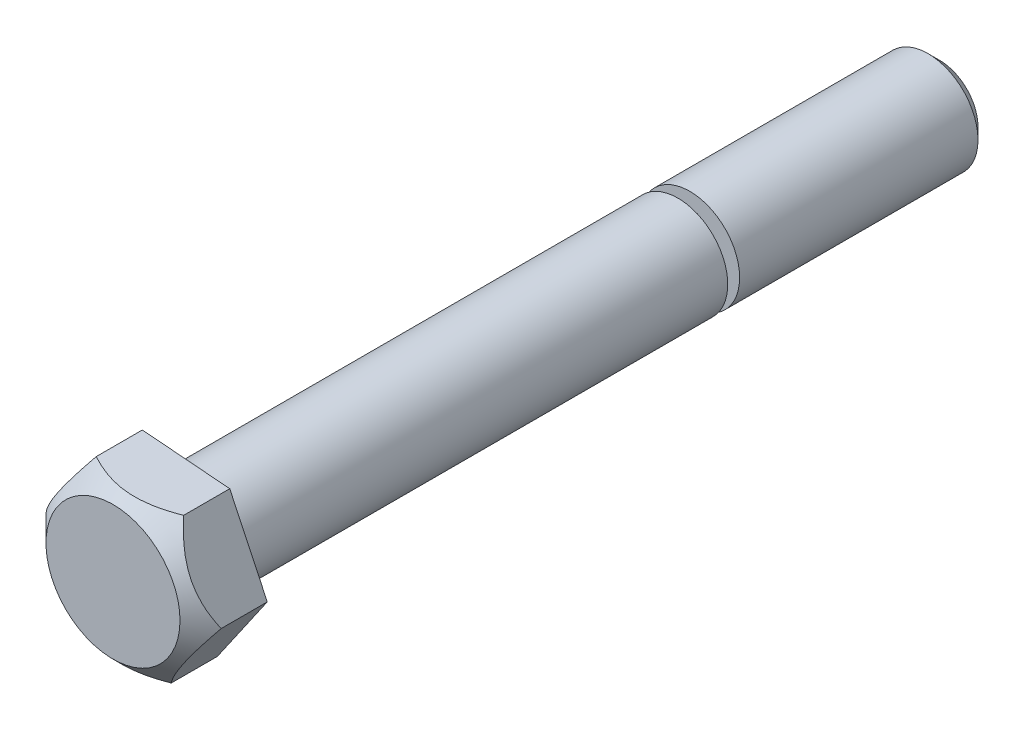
ISO-10303-21;
HEADER;
FILE_DESCRIPTION(('STEP AP214'),'2;1');
FILE_NAME('part.step','',(''),(''),'','','');
FILE_SCHEMA(('AUTOMOTIVE_DESIGN { 1 0 10303 214 1 1 1 1 }'));
ENDSEC;
DATA;
#1=APPLICATION_CONTEXT('core data for automotive mechanical design processes');
#2=APPLICATION_PROTOCOL_DEFINITION('international standard','automotive_design',2000,#1);
#3=PRODUCT_CONTEXT('',#1,'mechanical');
#4=PRODUCT('Part','Part','',(#3));
#5=PRODUCT_RELATED_PRODUCT_CATEGORY('part','',(#4));
#6=PRODUCT_DEFINITION_FORMATION('','',#4);
#7=PRODUCT_DEFINITION_CONTEXT('part definition',#1,'design');
#8=PRODUCT_DEFINITION('design','',#6,#7);
#9=PRODUCT_DEFINITION_SHAPE('','',#8);
#10=(LENGTH_UNIT() NAMED_UNIT(*) SI_UNIT(.MILLI.,.METRE.));
#11=(NAMED_UNIT(*) PLANE_ANGLE_UNIT() SI_UNIT($,.RADIAN.));
#12=(NAMED_UNIT(*) SI_UNIT($,.STERADIAN.) SOLID_ANGLE_UNIT());
#13=UNCERTAINTY_MEASURE_WITH_UNIT(LENGTH_MEASURE(1.E-05),#10,'distance_accuracy_value','');
#14=(GEOMETRIC_REPRESENTATION_CONTEXT(3) GLOBAL_UNCERTAINTY_ASSIGNED_CONTEXT((#13)) GLOBAL_UNIT_ASSIGNED_CONTEXT((#10,
#11,#12)) REPRESENTATION_CONTEXT('',''));
#15=CARTESIAN_POINT('',(0.,0.,0.));
#16=DIRECTION('',(0.,0.,1.));
#17=DIRECTION('',(1.,0.,0.));
#18=AXIS2_PLACEMENT_3D('',#15,#16,#17);
#19=CARTESIAN_POINT('',(0.,0.,31.75));
#20=DIRECTION('',(0.,0.,-1.));
#21=DIRECTION('',(-1.,0.,0.));
#22=AXIS2_PLACEMENT_3D('',#19,#20,#21);
#23=CYLINDRICAL_SURFACE('',#22,2.0828);
#24=CARTESIAN_POINT('',(0.,0.,10.4385878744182));
#25=DIRECTION('',(0.,0.,1.));
#26=DIRECTION('',(1.,0.,0.));
#27=AXIS2_PLACEMENT_3D('',#24,#25,#26);
#28=CIRCLE('',#27,2.0828);
#29=CARTESIAN_POINT('',(2.0828,0.,10.4385878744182));
#30=VERTEX_POINT('',#29);
#31=EDGE_CURVE('E119',#30,#30,#28,.T.);
#32=ORIENTED_EDGE('',*,*,#31,.F.);
#33=EDGE_LOOP('',(#32));
#34=FACE_BOUND('',#33,.T.);
#35=CARTESIAN_POINT('',(0.,0.,0.475372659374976));
#36=DIRECTION('',(0.,0.,1.));
#37=DIRECTION('',(1.,0.,0.));
#38=AXIS2_PLACEMENT_3D('',#35,#36,#37);
#39=CIRCLE('',#38,2.0828);
#40=CARTESIAN_POINT('',(2.0828,0.,0.475372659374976));
#41=VERTEX_POINT('',#40);
#42=EDGE_CURVE('E38',#41,#41,#39,.F.);
#43=ORIENTED_EDGE('',*,*,#42,.F.);
#44=EDGE_LOOP('',(#43));
#45=FACE_BOUND('',#44,.T.);
#46=ADVANCED_FACE('F34',(#34,#45),#23,.T.);
#47=CARTESIAN_POINT('',(1.56859845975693,-3.31365843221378,34.544));
#48=DIRECTION('',(-0.822458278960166,0.568825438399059,0.));
#49=DIRECTION('',(-0.568825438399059,-0.822458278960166,0.));
#50=AXIS2_PLACEMENT_3D('',#47,#48,#49);
#51=PLANE('',#50);
#52=CARTESIAN_POINT('',(1.56846013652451,-3.31385843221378,33.6783241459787));
#53=CARTESIAN_POINT('',(1.64014513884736,-3.21020989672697,33.7412813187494));
#54=CARTESIAN_POINT('',(1.71302880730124,-3.10482822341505,33.8005408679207));
#55=CARTESIAN_POINT('',(1.86164657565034,-2.88994347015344,33.9090435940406));
#56=CARTESIAN_POINT('',(1.93739480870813,-2.78041995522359,33.9582264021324));
#57=CARTESIAN_POINT('',(2.09013748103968,-2.55957104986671,34.0424774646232));
#58=CARTESIAN_POINT('',(2.16709302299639,-2.44830190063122,34.0777574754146));
#59=CARTESIAN_POINT('',(2.32269827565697,-2.22331402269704,34.1321135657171));
#60=CARTESIAN_POINT('',(2.40134323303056,-2.10960216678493,34.1512302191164));
#61=CARTESIAN_POINT('',(2.53688438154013,-1.9136247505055,34.1684785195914));
#62=CARTESIAN_POINT('',(2.59360553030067,-1.83161228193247,34.1710317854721));
#63=CARTESIAN_POINT('',(2.70695556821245,-1.66772074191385,34.1667295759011));
#64=CARTESIAN_POINT('',(2.76358441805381,-1.58584172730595,34.1598708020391));
#65=CARTESIAN_POINT('',(2.8763056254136,-1.42285940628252,34.1371361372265));
#66=CARTESIAN_POINT('',(2.93239731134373,-1.34175707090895,34.1212501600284));
#67=CARTESIAN_POINT('',(3.0436173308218,-1.18094530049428,34.0813281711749));
#68=CARTESIAN_POINT('',(3.09874573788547,-1.10123575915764,34.0572927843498));
#69=CARTESIAN_POINT('',(3.19661528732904,-0.959727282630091,34.0078406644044));
#70=CARTESIAN_POINT('',(3.2395730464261,-0.897615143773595,33.9837237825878));
#71=CARTESIAN_POINT('',(3.32471733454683,-0.774505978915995,33.9316031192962));
#72=CARTESIAN_POINT('',(3.36690383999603,-0.713508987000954,33.9035992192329));
#73=CARTESIAN_POINT('',(3.45037271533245,-0.59282228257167,33.8443323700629));
#74=CARTESIAN_POINT('',(3.49165745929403,-0.533129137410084,33.8130796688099));
#75=CARTESIAN_POINT('',(3.57346233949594,-0.414848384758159,33.7477256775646));
#76=CARTESIAN_POINT('',(3.61398292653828,-0.356260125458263,33.7136261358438));
#77=CARTESIAN_POINT('',(3.65414993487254,-0.298183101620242,33.6783241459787));
#78=B_SPLINE_CURVE_WITH_KNOTS('',3,(#52,#53,#54,#55,#56,#57,#58,#59,#60,#61,#62,#63,#64,#65,#66,
#67,#68,#69,#70,#71,#72,#73,#74,#75,#76,#77),.UNSPECIFIED.,.F.,.F.,(4,2,2,2,2,2,2,2,2,2,2,2,4),
(0.,0.422913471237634,0.848290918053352,1.26691269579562,1.68448048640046,1.98330429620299,
2.28223285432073,2.58149606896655,2.8807363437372,3.11845712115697,3.35618515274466,
3.59318483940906,3.83004003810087),.UNSPECIFIED.);
#79=CARTESIAN_POINT('',(1.56859845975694,-3.31365843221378,33.6784457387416));
#80=VERTEX_POINT('',#79);
#81=CARTESIAN_POINT('',(3.65401161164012,-0.298383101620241,33.6784457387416));
#82=VERTEX_POINT('',#81);
#83=EDGE_CURVE('E90',#80,#82,#78,.T.);
#84=ORIENTED_EDGE('',*,*,#83,.F.);
#85=DIRECTION('',(0.,0.,-1.));
#86=VECTOR('',#85,1.);
#87=CARTESIAN_POINT('',(1.56859845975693,-3.31365843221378,34.544));
#88=LINE('',#87,#86);
#89=CARTESIAN_POINT('',(1.56859845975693,-3.31365843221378,31.75));
#90=VERTEX_POINT('',#89);
#91=EDGE_CURVE('E59',#80,#90,#88,.T.);
#92=ORIENTED_EDGE('',*,*,#91,.T.);
#93=DIRECTION('',(0.568825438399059,0.822458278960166,0.));
#94=VECTOR('',#93,1.);
#95=CARTESIAN_POINT('',(1.56859845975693,-3.31365843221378,31.75));
#96=LINE('',#95,#94);
#97=CARTESIAN_POINT('',(3.65401161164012,-0.298383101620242,31.75));
#98=VERTEX_POINT('',#97);
#99=EDGE_CURVE('E125',#90,#98,#96,.T.);
#100=ORIENTED_EDGE('',*,*,#99,.T.);
#101=DIRECTION('',(0.,0.,-1.));
#102=VECTOR('',#101,1.);
#103=CARTESIAN_POINT('',(3.65401161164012,-0.298383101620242,34.544));
#104=LINE('',#103,#102);
#105=EDGE_CURVE('E43',#82,#98,#104,.T.);
#106=ORIENTED_EDGE('',*,*,#105,.F.);
#107=EDGE_LOOP('',(#84,#92,#100,#106));
#108=FACE_BOUND('',#107,.T.);
#109=ADVANCED_FACE('F97',(#108),#51,.F.);
#110=CARTESIAN_POINT('',(3.65401161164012,-0.298383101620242,34.544));
#111=DIRECTION('',(-0.903846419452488,-0.427857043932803,0.));
#112=DIRECTION('',(0.427857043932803,-0.903846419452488,0.));
#113=AXIS2_PLACEMENT_3D('',#110,#111,#112);
#114=PLANE('',#113);
#115=CARTESIAN_POINT('',(3.65410628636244,-0.298583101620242,33.6783350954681));
#116=CARTESIAN_POINT('',(3.60018708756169,-0.184678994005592,33.7412910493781));
#117=CARTESIAN_POINT('',(3.54536629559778,-0.0688702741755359,33.8005493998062));
#118=CARTESIAN_POINT('',(3.43358074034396,0.167276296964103,33.9090498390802));
#119=CARTESIAN_POINT('',(3.37660534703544,0.287636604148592,33.9582315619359));
#120=CARTESIAN_POINT('',(3.2617172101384,0.530337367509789,34.0424807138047));
#121=CARTESIAN_POINT('',(3.20383372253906,0.65261602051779,34.0777598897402));
#122=CARTESIAN_POINT('',(3.08679247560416,0.899865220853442,34.1321146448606));
#123=CARTESIAN_POINT('',(3.02763829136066,1.02482821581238,34.1512307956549));
#124=CARTESIAN_POINT('',(2.92568817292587,1.24019746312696,34.1684786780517));
#125=CARTESIAN_POINT('',(2.8830238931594,1.33032559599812,34.1710318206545));
#126=CARTESIAN_POINT('',(2.79776473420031,1.51043525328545,34.1667293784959));
#127=CARTESIAN_POINT('',(2.75516988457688,1.6004167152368,34.1598704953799));
#128=CARTESIAN_POINT('',(2.67038372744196,1.77952715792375,34.1371356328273));
#129=CARTESIAN_POINT('',(2.62819292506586,1.8686550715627,34.1212495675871));
#130=CARTESIAN_POINT('',(2.54453593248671,2.04538015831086,34.0813274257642));
#131=CARTESIAN_POINT('',(2.50306968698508,2.13297744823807,34.0572919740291));
#132=CARTESIAN_POINT('',(2.42945551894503,2.28848710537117,34.0078403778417));
#133=CARTESIAN_POINT('',(2.39714464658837,2.3567437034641,33.9837242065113));
#134=CARTESIAN_POINT('',(2.33310296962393,2.4920315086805,33.9316051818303));
#135=CARTESIAN_POINT('',(2.30137218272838,2.55906267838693,33.9036022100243));
#136=CARTESIAN_POINT('',(2.23859064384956,2.69168844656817,33.8443373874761));
#137=CARTESIAN_POINT('',(2.20753810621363,2.75728681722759,33.8130857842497));
#138=CARTESIAN_POINT('',(2.14600811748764,2.88726869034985,33.747734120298));
#139=CARTESIAN_POINT('',(2.11553032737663,2.95165290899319,33.7136358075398));
#140=CARTESIAN_POINT('',(2.08531847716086,3.01547533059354,33.6783350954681));
#141=B_SPLINE_CURVE_WITH_KNOTS('',3,(#115,#116,#117,#118,#119,#120,#121,#122,#123,#124,#125,
#126,#127,#128,#129,#130,#131,#132,#133,#134,#135,#136,#137,#138,#139,#140),.UNSPECIFIED.,.F.,
.F.,(4,2,2,2,2,2,2,2,2,2,2,2,4),(0.,0.422908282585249,0.848280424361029,1.26689717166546,
1.68445998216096,1.98328359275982,2.28221194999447,2.58147494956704,2.88071500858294,
3.11842888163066,3.35615000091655,3.59314278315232,3.82999110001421),.UNSPECIFIED.);
#142=CARTESIAN_POINT('',(2.08541315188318,3.01527533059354,33.6784457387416));
#143=VERTEX_POINT('',#142);
#144=EDGE_CURVE('E99',#82,#143,#141,.T.);
#145=ORIENTED_EDGE('',*,*,#144,.F.);
#146=ORIENTED_EDGE('',*,*,#105,.T.);
#147=DIRECTION('',(-0.427857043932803,0.903846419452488,0.));
#148=VECTOR('',#147,1.);
#149=CARTESIAN_POINT('',(3.65401161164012,-0.298383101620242,31.75));
#150=LINE('',#149,#148);
#151=CARTESIAN_POINT('',(2.08541315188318,3.01527533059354,31.75));
#152=VERTEX_POINT('',#151);
#153=EDGE_CURVE('E341',#98,#152,#150,.T.);
#154=ORIENTED_EDGE('',*,*,#153,.T.);
#155=DIRECTION('',(0.,0.,-1.));
#156=VECTOR('',#155,1.);
#157=CARTESIAN_POINT('',(2.08541315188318,3.01527533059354,34.544));
#158=LINE('',#157,#156);
#159=EDGE_CURVE('E116',#143,#152,#158,.T.);
#160=ORIENTED_EDGE('',*,*,#159,.F.);
#161=EDGE_LOOP('',(#145,#146,#154,#160));
#162=FACE_BOUND('',#161,.T.);
#163=ADVANCED_FACE('F184',(#162),#114,.F.);
#164=CARTESIAN_POINT('',(2.08541315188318,3.01527533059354,34.544));
#165=DIRECTION('',(-0.0813881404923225,-0.996682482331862,0.));
#166=DIRECTION('',(0.996682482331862,-0.0813881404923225,0.));
#167=AXIS2_PLACEMENT_3D('',#164,#165,#166);
#168=PLANE('',#167);
#169=CARTESIAN_POINT('',(2.08561315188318,3.01525899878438,33.6783454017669));
#170=CARTESIAN_POINT('',(1.96001094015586,3.02551555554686,33.7413002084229));
#171=CARTESIAN_POINT('',(1.83230852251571,3.03594361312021,33.8005574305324));
#172=CARTESIAN_POINT('',(1.57190948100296,3.05720755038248,33.9090557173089));
#173=CARTESIAN_POINT('',(1.43918809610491,3.06804545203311,33.9582364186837));
#174=CARTESIAN_POINT('',(1.17156182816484,3.08989955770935,34.0424837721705));
#175=CARTESIAN_POINT('',(1.03672509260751,3.10091019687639,34.0777621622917));
#176=CARTESIAN_POINT('',(0.764083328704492,3.12317386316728,34.1321156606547));
#177=CARTESIAN_POINT('',(0.626286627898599,3.13442621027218,34.1512313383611));
#178=CARTESIAN_POINT('',(0.388797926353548,3.15381931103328,34.1684788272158));
#179=CARTESIAN_POINT('',(0.289412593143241,3.1619350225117,34.17103185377));
#180=CARTESIAN_POINT('',(0.0908036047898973,3.17815324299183,34.1667291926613));
#181=CARTESIAN_POINT('',(-0.00841998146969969,3.18625574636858,34.1598702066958));
#182=CARTESIAN_POINT('',(-0.205927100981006,3.20238398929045,34.1371351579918));
#183=CARTESIAN_POINT('',(-0.304209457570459,3.21040963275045,34.1212490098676));
#184=CARTESIAN_POINT('',(-0.499086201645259,3.22632308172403,34.081326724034));
#185=CARTESIAN_POINT('',(-0.595680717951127,3.23421089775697,34.0572912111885));
#186=CARTESIAN_POINT('',(-0.767160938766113,3.24821380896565,34.0078401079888));
#187=CARTESIAN_POINT('',(-0.842426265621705,3.25435990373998,33.9837246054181));
#188=CARTESIAN_POINT('',(-0.991605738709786,3.26654175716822,33.9316071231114));
#189=CARTESIAN_POINT('',(-1.0655198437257,3.27257751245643,33.9036050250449));
#190=CARTESIAN_POINT('',(-1.21176400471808,3.28451967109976,33.8443421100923));
#191=CARTESIAN_POINT('',(-1.28409822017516,3.29042641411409,33.813091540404));
#192=CARTESIAN_POINT('',(-1.4274270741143,3.30213051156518,33.7477420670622));
#193=CARTESIAN_POINT('',(-1.49842250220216,3.30792793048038,33.7136449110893));
#194=CARTESIAN_POINT('',(-1.56879845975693,3.31367476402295,33.6783454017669));
#195=B_SPLINE_CURVE_WITH_KNOTS('',3,(#169,#170,#171,#172,#173,#174,#175,#176,#177,#178,#179,
#180,#181,#182,#183,#184,#185,#186,#187,#188,#189,#190,#191,#192,#193,#194),.UNSPECIFIED.,.F.,
.F.,(4,2,2,2,2,2,2,2,2,2,2,2,4),(0.,0.422903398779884,0.848270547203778,1.26688255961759,
1.68444068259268,1.98326410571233,2.28219227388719,2.5814550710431,2.88069492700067,
3.11840230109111,3.3561169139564,3.59310319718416,3.829945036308),.UNSPECIFIED.);
#196=CARTESIAN_POINT('',(-1.56859845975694,3.31365843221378,33.6784457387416));
#197=VERTEX_POINT('',#196);
#198=EDGE_CURVE('E169',#143,#197,#195,.T.);
#199=ORIENTED_EDGE('',*,*,#198,.F.);
#200=ORIENTED_EDGE('',*,*,#159,.T.);
#201=DIRECTION('',(-0.996682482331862,0.0813881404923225,0.));
#202=VECTOR('',#201,1.);
#203=CARTESIAN_POINT('',(2.08541315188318,3.01527533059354,31.75));
#204=LINE('',#203,#202);
#205=CARTESIAN_POINT('',(-1.56859845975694,3.31365843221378,31.75));
#206=VERTEX_POINT('',#205);
#207=EDGE_CURVE('E336',#152,#206,#204,.T.);
#208=ORIENTED_EDGE('',*,*,#207,.T.);
#209=DIRECTION('',(0.,0.,-1.));
#210=VECTOR('',#209,1.);
#211=CARTESIAN_POINT('',(-1.56859845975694,3.31365843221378,34.544));
#212=LINE('',#211,#210);
#213=EDGE_CURVE('E114',#197,#206,#212,.T.);
#214=ORIENTED_EDGE('',*,*,#213,.F.);
#215=EDGE_LOOP('',(#199,#200,#208,#214));
#216=FACE_BOUND('',#215,.T.);
#217=ADVANCED_FACE('F187',(#216),#168,.F.);
#218=CARTESIAN_POINT('',(-1.56859845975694,3.31365843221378,34.544));
#219=DIRECTION('',(0.822458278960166,-0.568825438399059,0.));
#220=DIRECTION('',(0.568825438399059,0.822458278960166,0.));
#221=AXIS2_PLACEMENT_3D('',#218,#219,#220);
#222=PLANE('',#221);
#223=CARTESIAN_POINT('',(-1.56846013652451,3.31385843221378,33.6783241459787));
#224=CARTESIAN_POINT('',(-1.64014513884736,3.21020989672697,33.7412813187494));
#225=CARTESIAN_POINT('',(-1.71302880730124,3.10482822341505,33.8005408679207));
#226=CARTESIAN_POINT('',(-1.86164657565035,2.88994347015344,33.9090435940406));
#227=CARTESIAN_POINT('',(-1.93739480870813,2.78041995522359,33.9582264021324));
#228=CARTESIAN_POINT('',(-2.09013748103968,2.55957104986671,34.0424774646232));
#229=CARTESIAN_POINT('',(-2.1670930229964,2.44830190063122,34.0777574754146));
#230=CARTESIAN_POINT('',(-2.32269827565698,2.22331402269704,34.1321135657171));
#231=CARTESIAN_POINT('',(-2.40134323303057,2.10960216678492,34.1512302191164));
#232=CARTESIAN_POINT('',(-2.53688438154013,1.91362475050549,34.1684785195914));
#233=CARTESIAN_POINT('',(-2.59360553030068,1.83161228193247,34.1710317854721));
#234=CARTESIAN_POINT('',(-2.70695556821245,1.66772074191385,34.1667295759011));
#235=CARTESIAN_POINT('',(-2.76358441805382,1.58584172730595,34.1598708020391));
#236=CARTESIAN_POINT('',(-2.87630562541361,1.42285940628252,34.1371361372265));
#237=CARTESIAN_POINT('',(-2.93239731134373,1.34175707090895,34.1212501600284));
#238=CARTESIAN_POINT('',(-3.04361733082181,1.18094530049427,34.0813281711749));
#239=CARTESIAN_POINT('',(-3.09874573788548,1.10123575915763,34.0572927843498));
#240=CARTESIAN_POINT('',(-3.19661528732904,0.959727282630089,34.0078406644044));
#241=CARTESIAN_POINT('',(-3.2395730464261,0.897615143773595,33.9837237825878));
#242=CARTESIAN_POINT('',(-3.32471733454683,0.774505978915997,33.9316031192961));
#243=CARTESIAN_POINT('',(-3.36690383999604,0.713508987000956,33.9035992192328));
#244=CARTESIAN_POINT('',(-3.45037271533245,0.592822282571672,33.8443323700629));
#245=CARTESIAN_POINT('',(-3.49165745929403,0.533129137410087,33.8130796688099));
#246=CARTESIAN_POINT('',(-3.57346233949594,0.414848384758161,33.7477256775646));
#247=CARTESIAN_POINT('',(-3.61398292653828,0.356260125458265,33.7136261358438));
#248=CARTESIAN_POINT('',(-3.65414993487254,0.298183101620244,33.6783241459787));
#249=B_SPLINE_CURVE_WITH_KNOTS('',3,(#223,#224,#225,#226,#227,#228,#229,#230,#231,#232,#233,
#234,#235,#236,#237,#238,#239,#240,#241,#242,#243,#244,#245,#246,#247,#248),.UNSPECIFIED.,.F.,
.F.,(4,2,2,2,2,2,2,2,2,2,2,2,4),(0.,0.422913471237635,0.848290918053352,1.26691269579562,
1.68448048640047,1.98330429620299,2.28223285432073,2.58149606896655,2.8807363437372,
3.11845712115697,3.35618515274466,3.59318483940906,3.83004003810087),.UNSPECIFIED.);
#250=CARTESIAN_POINT('',(-3.65401161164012,0.298383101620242,33.6784457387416));
#251=VERTEX_POINT('',#250);
#252=EDGE_CURVE('E163',#197,#251,#249,.T.);
#253=ORIENTED_EDGE('',*,*,#252,.F.);
#254=ORIENTED_EDGE('',*,*,#213,.T.);
#255=DIRECTION('',(-0.568825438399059,-0.822458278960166,0.));
#256=VECTOR('',#255,1.);
#257=CARTESIAN_POINT('',(-1.56859845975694,3.31365843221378,31.75));
#258=LINE('',#257,#256);
#259=CARTESIAN_POINT('',(-3.65401161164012,0.298383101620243,31.75));
#260=VERTEX_POINT('',#259);
#261=EDGE_CURVE('E332',#206,#260,#258,.T.);
#262=ORIENTED_EDGE('',*,*,#261,.T.);
#263=DIRECTION('',(0.,0.,-1.));
#264=VECTOR('',#263,1.);
#265=CARTESIAN_POINT('',(-3.65401161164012,0.298383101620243,34.544));
#266=LINE('',#265,#264);
#267=EDGE_CURVE('E107',#251,#260,#266,.T.);
#268=ORIENTED_EDGE('',*,*,#267,.F.);
#269=EDGE_LOOP('',(#253,#254,#262,#268));
#270=FACE_BOUND('',#269,.T.);
#271=ADVANCED_FACE('F286',(#270),#222,.F.);
#272=CARTESIAN_POINT('',(-3.65401161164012,0.298383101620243,34.544));
#273=DIRECTION('',(0.903846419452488,0.427857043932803,0.));
#274=DIRECTION('',(-0.427857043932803,0.903846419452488,0.));
#275=AXIS2_PLACEMENT_3D('',#272,#273,#274);
#276=PLANE('',#275);
#277=CARTESIAN_POINT('',(-3.65410628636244,0.298583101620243,33.6783350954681));
#278=CARTESIAN_POINT('',(-3.60018708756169,0.184678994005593,33.7412910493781));
#279=CARTESIAN_POINT('',(-3.54536629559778,0.0688702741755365,33.8005493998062));
#280=CARTESIAN_POINT('',(-3.43358074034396,-0.167276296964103,33.9090498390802));
#281=CARTESIAN_POINT('',(-3.37660534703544,-0.287636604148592,33.9582315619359));
#282=CARTESIAN_POINT('',(-3.2617172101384,-0.530337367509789,34.0424807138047));
#283=CARTESIAN_POINT('',(-3.20383372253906,-0.65261602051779,34.0777598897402));
#284=CARTESIAN_POINT('',(-3.08679247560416,-0.899865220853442,34.1321146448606));
#285=CARTESIAN_POINT('',(-3.02763829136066,-1.02482821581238,34.1512307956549));
#286=CARTESIAN_POINT('',(-2.92568817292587,-1.24019746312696,34.1684786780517));
#287=CARTESIAN_POINT('',(-2.8830238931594,-1.33032559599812,34.1710318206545));
#288=CARTESIAN_POINT('',(-2.79776473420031,-1.51043525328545,34.1667293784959));
#289=CARTESIAN_POINT('',(-2.75516988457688,-1.6004167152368,34.1598704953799));
#290=CARTESIAN_POINT('',(-2.67038372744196,-1.77952715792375,34.1371356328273));
#291=CARTESIAN_POINT('',(-2.62819292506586,-1.8686550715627,34.1212495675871));
#292=CARTESIAN_POINT('',(-2.54453593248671,-2.04538015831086,34.0813274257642));
#293=CARTESIAN_POINT('',(-2.50306968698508,-2.13297744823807,34.0572919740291));
#294=CARTESIAN_POINT('',(-2.42945551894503,-2.28848710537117,34.0078403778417));
#295=CARTESIAN_POINT('',(-2.39714464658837,-2.35674370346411,33.9837242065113));
#296=CARTESIAN_POINT('',(-2.33310296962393,-2.49203150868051,33.9316051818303));
#297=CARTESIAN_POINT('',(-2.30137218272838,-2.55906267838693,33.9036022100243));
#298=CARTESIAN_POINT('',(-2.23859064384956,-2.69168844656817,33.8443373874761));
#299=CARTESIAN_POINT('',(-2.20753810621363,-2.75728681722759,33.8130857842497));
#300=CARTESIAN_POINT('',(-2.14600811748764,-2.88726869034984,33.747734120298));
#301=CARTESIAN_POINT('',(-2.11553032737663,-2.95165290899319,33.7136358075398));
#302=CARTESIAN_POINT('',(-2.08531847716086,-3.01547533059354,33.6783350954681));
#303=B_SPLINE_CURVE_WITH_KNOTS('',3,(#277,#278,#279,#280,#281,#282,#283,#284,#285,#286,#287,
#288,#289,#290,#291,#292,#293,#294,#295,#296,#297,#298,#299,#300,#301,#302),.UNSPECIFIED.,.F.,
.F.,(4,2,2,2,2,2,2,2,2,2,2,2,4),(0.,0.42290828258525,0.848280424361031,1.26689717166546,
1.68445998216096,1.98328359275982,2.28221194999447,2.58147494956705,2.88071500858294,
3.11842888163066,3.35615000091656,3.59314278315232,3.82999110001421),.UNSPECIFIED.);
#304=CARTESIAN_POINT('',(-2.08541315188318,-3.01527533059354,33.6784457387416));
#305=VERTEX_POINT('',#304);
#306=EDGE_CURVE('E51',#251,#305,#303,.T.);
#307=ORIENTED_EDGE('',*,*,#306,.F.);
#308=ORIENTED_EDGE('',*,*,#267,.T.);
#309=DIRECTION('',(0.427857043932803,-0.903846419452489,0.));
#310=VECTOR('',#309,1.);
#311=CARTESIAN_POINT('',(-3.65401161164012,0.298383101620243,31.75));
#312=LINE('',#311,#310);
#313=CARTESIAN_POINT('',(-2.08541315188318,-3.01527533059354,31.75));
#314=VERTEX_POINT('',#313);
#315=EDGE_CURVE('E109',#260,#314,#312,.T.);
#316=ORIENTED_EDGE('',*,*,#315,.T.);
#317=DIRECTION('',(0.,0.,-1.));
#318=VECTOR('',#317,1.);
#319=CARTESIAN_POINT('',(-2.08541315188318,-3.01527533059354,34.544));
#320=LINE('',#319,#318);
#321=EDGE_CURVE('E105',#305,#314,#320,.T.);
#322=ORIENTED_EDGE('',*,*,#321,.F.);
#323=EDGE_LOOP('',(#307,#308,#316,#322));
#324=FACE_BOUND('',#323,.T.);
#325=ADVANCED_FACE('F214',(#324),#276,.F.);
#326=CARTESIAN_POINT('',(-2.08541315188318,-3.01527533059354,34.544));
#327=DIRECTION('',(0.0813881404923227,0.996682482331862,0.));
#328=DIRECTION('',(-0.996682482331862,0.0813881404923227,0.));
#329=AXIS2_PLACEMENT_3D('',#326,#327,#328);
#330=PLANE('',#329);
#331=CARTESIAN_POINT('',(-2.08561315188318,-3.01525899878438,33.6783454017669));
#332=CARTESIAN_POINT('',(-1.96001094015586,-3.02551555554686,33.7413002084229));
#333=CARTESIAN_POINT('',(-1.83230852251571,-3.03594361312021,33.8005574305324));
#334=CARTESIAN_POINT('',(-1.57190948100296,-3.05720755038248,33.9090557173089));
#335=CARTESIAN_POINT('',(-1.43918809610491,-3.06804545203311,33.9582364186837));
#336=CARTESIAN_POINT('',(-1.17156182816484,-3.08989955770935,34.0424837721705));
#337=CARTESIAN_POINT('',(-1.03672509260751,-3.10091019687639,34.0777621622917));
#338=CARTESIAN_POINT('',(-0.764083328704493,-3.12317386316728,34.1321156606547));
#339=CARTESIAN_POINT('',(-0.6262866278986,-3.13442621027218,34.1512313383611));
#340=CARTESIAN_POINT('',(-0.388797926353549,-3.15381931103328,34.1684788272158));
#341=CARTESIAN_POINT('',(-0.289412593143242,-3.1619350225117,34.17103185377));
#342=CARTESIAN_POINT('',(-0.0908036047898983,-3.17815324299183,34.1667291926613));
#343=CARTESIAN_POINT('',(0.00841998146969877,-3.18625574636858,34.1598702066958));
#344=CARTESIAN_POINT('',(0.205927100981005,-3.20238398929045,34.1371351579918));
#345=CARTESIAN_POINT('',(0.304209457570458,-3.21040963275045,34.1212490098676));
#346=CARTESIAN_POINT('',(0.499086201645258,-3.22632308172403,34.081326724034));
#347=CARTESIAN_POINT('',(0.595680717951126,-3.23421089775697,34.0572912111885));
#348=CARTESIAN_POINT('',(0.767160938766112,-3.24821380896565,34.0078401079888));
#349=CARTESIAN_POINT('',(0.842426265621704,-3.25435990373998,33.9837246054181));
#350=CARTESIAN_POINT('',(0.991605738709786,-3.26654175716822,33.9316071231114));
#351=CARTESIAN_POINT('',(1.0655198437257,-3.27257751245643,33.9036050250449));
#352=CARTESIAN_POINT('',(1.21176400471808,-3.28451967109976,33.8443421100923));
#353=CARTESIAN_POINT('',(1.28409822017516,-3.29042641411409,33.813091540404));
#354=CARTESIAN_POINT('',(1.4274270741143,-3.30213051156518,33.7477420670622));
#355=CARTESIAN_POINT('',(1.49842250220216,-3.30792793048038,33.7136449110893));
#356=CARTESIAN_POINT('',(1.56879845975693,-3.31367476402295,33.6783454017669));
#357=B_SPLINE_CURVE_WITH_KNOTS('',3,(#331,#332,#333,#334,#335,#336,#337,#338,#339,#340,#341,
#342,#343,#344,#345,#346,#347,#348,#349,#350,#351,#352,#353,#354,#355,#356),.UNSPECIFIED.,.F.,
.F.,(4,2,2,2,2,2,2,2,2,2,2,2,4),(0.,0.422903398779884,0.848270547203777,1.26688255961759,
1.68444068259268,1.98326410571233,2.28219227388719,2.5814550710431,2.88069492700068,
3.11840230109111,3.3561169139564,3.59310319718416,3.829945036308),.UNSPECIFIED.);
#358=EDGE_CURVE('E88',#305,#80,#357,.T.);
#359=ORIENTED_EDGE('',*,*,#358,.F.);
#360=ORIENTED_EDGE('',*,*,#321,.T.);
#361=DIRECTION('',(0.996682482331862,-0.0813881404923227,0.));
#362=VECTOR('',#361,1.);
#363=CARTESIAN_POINT('',(-2.08541315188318,-3.01527533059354,31.75));
#364=LINE('',#363,#362);
#365=EDGE_CURVE('E103',#314,#90,#364,.T.);
#366=ORIENTED_EDGE('',*,*,#365,.T.);
#367=ORIENTED_EDGE('',*,*,#91,.F.);
#368=EDGE_LOOP('',(#359,#360,#366,#367));
#369=FACE_BOUND('',#368,.T.);
#370=ADVANCED_FACE('F101',(#369),#330,.F.);
#371=CARTESIAN_POINT('',(0.,0.,31.75));
#372=DIRECTION('',(0.,0.,1.));
#373=DIRECTION('',(1.,0.,0.));
#374=AXIS2_PLACEMENT_3D('',#371,#372,#373);
#375=CIRCLE('',#374,2.0828);
#376=CARTESIAN_POINT('',(2.0828,0.,31.75));
#377=VERTEX_POINT('',#376);
#378=EDGE_CURVE('E11',#377,#377,#375,.T.);
#379=ORIENTED_EDGE('',*,*,#378,.F.);
#380=EDGE_LOOP('',(#379));
#381=FACE_BOUND('',#380,.T.);
#382=CARTESIAN_POINT('',(0.,0.,10.9334906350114));
#383=DIRECTION('',(0.,0.,-1.));
#384=DIRECTION('',(-1.,0.,0.));
#385=AXIS2_PLACEMENT_3D('',#382,#383,#384);
#386=CIRCLE('',#385,2.0828);
#387=CARTESIAN_POINT('',(-2.0828,0.,10.9334906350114));
#388=VERTEX_POINT('',#387);
#389=EDGE_CURVE('E122',#388,#388,#386,.T.);
#390=ORIENTED_EDGE('',*,*,#389,.F.);
#391=EDGE_LOOP('',(#390));
#392=FACE_BOUND('',#391,.T.);
#393=ADVANCED_FACE('F36',(#381,#392),#23,.T.);
#394=CARTESIAN_POINT('',(3.65401161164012,-0.298383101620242,31.75));
#395=DIRECTION('',(0.,0.,1.));
#396=DIRECTION('',(1.,0.,0.));
#397=AXIS2_PLACEMENT_3D('',#394,#395,#396);
#398=PLANE('',#397);
#399=ORIENTED_EDGE('',*,*,#99,.F.);
#400=ORIENTED_EDGE('',*,*,#365,.F.);
#401=ORIENTED_EDGE('',*,*,#315,.F.);
#402=ORIENTED_EDGE('',*,*,#261,.F.);
#403=ORIENTED_EDGE('',*,*,#207,.F.);
#404=ORIENTED_EDGE('',*,*,#153,.F.);
#405=EDGE_LOOP('',(#399,#400,#401,#402,#403,#404));
#406=FACE_BOUND('',#405,.T.);
#407=ORIENTED_EDGE('',*,*,#378,.T.);
#408=EDGE_LOOP('',(#407));
#409=FACE_BOUND('',#408,.T.);
#410=ADVANCED_FACE('F206',(#406,#409),#398,.F.);
#411=CARTESIAN_POINT('',(3.39325228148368,0.,10.9334906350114));
#412=DIRECTION('',(0.,0.,-1.));
#413=DIRECTION('',(-1.,0.,0.));
#414=AXIS2_PLACEMENT_3D('',#411,#412,#413);
#415=PLANE('',#414);
#416=CARTESIAN_POINT('',(0.,0.,10.9334906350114));
#417=DIRECTION('',(0.,0.,-1.));
#418=DIRECTION('',(-1.,0.,0.));
#419=AXIS2_PLACEMENT_3D('',#416,#417,#418);
#420=CIRCLE('',#419,1.2104589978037);
#421=CARTESIAN_POINT('',(-1.2104589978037,0.,10.9334906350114));
#422=VERTEX_POINT('',#421);
#423=EDGE_CURVE('E123',#422,#422,#420,.T.);
#424=ORIENTED_EDGE('',*,*,#423,.F.);
#425=EDGE_LOOP('',(#424));
#426=FACE_BOUND('',#425,.T.);
#427=ORIENTED_EDGE('',*,*,#389,.T.);
#428=EDGE_LOOP('',(#427));
#429=FACE_BOUND('',#428,.T.);
#430=ADVANCED_FACE('F212',(#426,#429),#415,.T.);
#431=CARTESIAN_POINT('',(3.39325228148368,0.,10.4385878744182));
#432=DIRECTION('',(0.,0.,1.));
#433=DIRECTION('',(1.,0.,0.));
#434=AXIS2_PLACEMENT_3D('',#431,#432,#433);
#435=PLANE('',#434);
#436=CARTESIAN_POINT('',(0.,0.,10.4385878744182));
#437=DIRECTION('',(0.,0.,-1.));
#438=DIRECTION('',(-1.,0.,0.));
#439=AXIS2_PLACEMENT_3D('',#436,#437,#438);
#440=CIRCLE('',#439,1.2104589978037);
#441=CARTESIAN_POINT('',(-1.2104589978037,0.,10.4385878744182));
#442=VERTEX_POINT('',#441);
#443=EDGE_CURVE('E98',#442,#442,#440,.T.);
#444=ORIENTED_EDGE('',*,*,#443,.T.);
#445=EDGE_LOOP('',(#444));
#446=FACE_BOUND('',#445,.T.);
#447=ORIENTED_EDGE('',*,*,#31,.T.);
#448=EDGE_LOOP('',(#447));
#449=FACE_BOUND('',#448,.T.);
#450=ADVANCED_FACE('F156',(#446,#449),#435,.T.);
#451=CARTESIAN_POINT('',(0.,0.,0.));
#452=DIRECTION('',(0.,0.,-1.));
#453=DIRECTION('',(-1.,0.,0.));
#454=AXIS2_PLACEMENT_3D('',#451,#452,#453);
#455=CYLINDRICAL_SURFACE('',#454,1.2104589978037);
#456=ORIENTED_EDGE('',*,*,#423,.T.);
#457=EDGE_LOOP('',(#456));
#458=FACE_BOUND('',#457,.T.);
#459=ORIENTED_EDGE('',*,*,#443,.F.);
#460=EDGE_LOOP('',(#459));
#461=FACE_BOUND('',#460,.T.);
#462=ADVANCED_FACE('F153',(#458,#461),#455,.T.);
#463=CARTESIAN_POINT('',(0.,0.,31.9688447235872));
#464=DIRECTION('',(0.,0.,-1.));
#465=DIRECTION('',(-1.,0.,0.));
#466=AXIS2_PLACEMENT_3D('',#463,#464,#465);
#467=CONICAL_SURFACE('',#466,5.37577522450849,0.785398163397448);
#468=CARTESIAN_POINT('',(0.,0.,34.544));
#469=DIRECTION('',(0.,0.,1.));
#470=DIRECTION('',(1.,0.,0.));
#471=AXIS2_PLACEMENT_3D('',#468,#469,#470);
#472=CIRCLE('',#471,2.80061994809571);
#473=CARTESIAN_POINT('',(2.80061994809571,0.,34.544));
#474=VERTEX_POINT('',#473);
#475=EDGE_CURVE('E94',#474,#474,#472,.T.);
#476=ORIENTED_EDGE('',*,*,#475,.F.);
#477=EDGE_LOOP('',(#476));
#478=FACE_BOUND('',#477,.T.);
#479=ORIENTED_EDGE('',*,*,#83,.T.);
#480=ORIENTED_EDGE('',*,*,#144,.T.);
#481=ORIENTED_EDGE('',*,*,#198,.T.);
#482=ORIENTED_EDGE('',*,*,#252,.T.);
#483=ORIENTED_EDGE('',*,*,#306,.T.);
#484=ORIENTED_EDGE('',*,*,#358,.T.);
#485=EDGE_LOOP('',(#479,#480,#481,#482,#483,#484));
#486=FACE_BOUND('',#485,.T.);
#487=ADVANCED_FACE('F89',(#478,#486),#467,.T.);
#488=CARTESIAN_POINT('',(3.65401161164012,-0.298383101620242,34.544));
#489=DIRECTION('',(0.,0.,1.));
#490=DIRECTION('',(1.,0.,0.));
#491=AXIS2_PLACEMENT_3D('',#488,#489,#490);
#492=PLANE('',#491);
#493=ORIENTED_EDGE('',*,*,#475,.T.);
#494=EDGE_LOOP('',(#493));
#495=FACE_BOUND('',#494,.T.);
#496=ADVANCED_FACE('F152',(#495),#492,.T.);
#497=CARTESIAN_POINT('',(0.,0.,1.80371831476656));
#498=DIRECTION('',(0.,0.,1.));
#499=DIRECTION('',(1.,0.,0.));
#500=AXIS2_PLACEMENT_3D('',#497,#498,#499);
#501=CONICAL_SURFACE('',#500,3.41114565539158,0.785398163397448);
#502=ORIENTED_EDGE('',*,*,#42,.T.);
#503=EDGE_LOOP('',(#502));
#504=FACE_BOUND('',#503,.T.);
#505=CARTESIAN_POINT('',(0.,0.,0.));
#506=DIRECTION('',(0.,0.,1.));
#507=DIRECTION('',(1.,0.,0.));
#508=AXIS2_PLACEMENT_3D('',#505,#506,#507);
#509=CIRCLE('',#508,1.60742734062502);
#510=CARTESIAN_POINT('',(1.60742734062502,0.,0.));
#511=VERTEX_POINT('',#510);
#512=EDGE_CURVE('E127',#511,#511,#509,.T.);
#513=ORIENTED_EDGE('',*,*,#512,.T.);
#514=EDGE_LOOP('',(#513));
#515=FACE_BOUND('',#514,.T.);
#516=ADVANCED_FACE('F155',(#504,#515),#501,.T.);
#517=CARTESIAN_POINT('',(0.,0.,0.));
#518=DIRECTION('',(0.,0.,1.));
#519=DIRECTION('',(1.,0.,0.));
#520=AXIS2_PLACEMENT_3D('',#517,#518,#519);
#521=PLANE('',#520);
#522=ORIENTED_EDGE('',*,*,#512,.F.);
#523=EDGE_LOOP('',(#522));
#524=FACE_BOUND('',#523,.T.);
#525=ADVANCED_FACE('F192',(#524),#521,.F.);
#526=CLOSED_SHELL('',(#46,#109,#163,#217,#271,#325,#370,#393,#410,#430,#450,#462,#487,#496,#516,#525));
#527=MANIFOLD_SOLID_BREP('B2',#526);
#528=ADVANCED_BREP_SHAPE_REPRESENTATION('',(#18,#527),#14);
#529=SHAPE_DEFINITION_REPRESENTATION(#9,#528);
ENDSEC;
END-ISO-10303-21;
